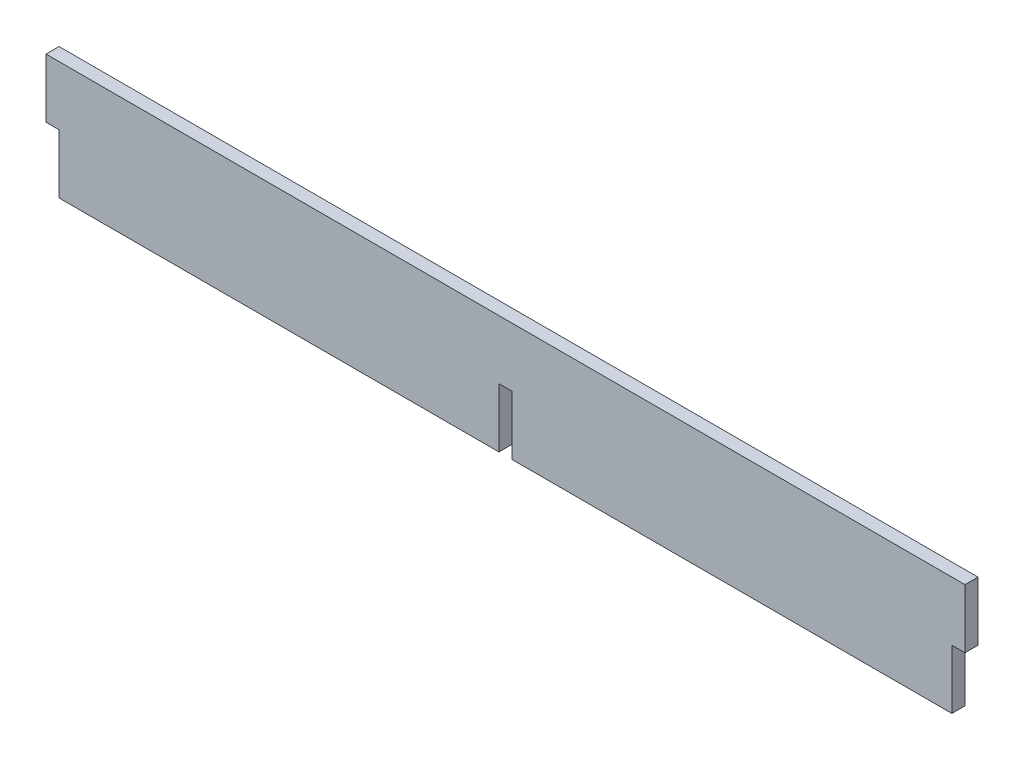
ISO-10303-21;
HEADER;
FILE_DESCRIPTION(('STEP AP214'),'2;1');
FILE_NAME('part.step','',(''),(''),'','','');
FILE_SCHEMA(('AUTOMOTIVE_DESIGN { 1 0 10303 214 1 1 1 1 }'));
ENDSEC;
DATA;
#1=APPLICATION_CONTEXT('core data for automotive mechanical design processes');
#2=APPLICATION_PROTOCOL_DEFINITION('international standard','automotive_design',2000,#1);
#3=PRODUCT_CONTEXT('',#1,'mechanical');
#4=PRODUCT('Part','Part','',(#3));
#5=PRODUCT_RELATED_PRODUCT_CATEGORY('part','',(#4));
#6=PRODUCT_DEFINITION_FORMATION('','',#4);
#7=PRODUCT_DEFINITION_CONTEXT('part definition',#1,'design');
#8=PRODUCT_DEFINITION('design','',#6,#7);
#9=PRODUCT_DEFINITION_SHAPE('','',#8);
#10=(LENGTH_UNIT() NAMED_UNIT(*) SI_UNIT(.MILLI.,.METRE.));
#11=(NAMED_UNIT(*) PLANE_ANGLE_UNIT() SI_UNIT($,.RADIAN.));
#12=(NAMED_UNIT(*) SI_UNIT($,.STERADIAN.) SOLID_ANGLE_UNIT());
#13=UNCERTAINTY_MEASURE_WITH_UNIT(LENGTH_MEASURE(1.E-05),#10,'distance_accuracy_value','');
#14=(GEOMETRIC_REPRESENTATION_CONTEXT(3) GLOBAL_UNCERTAINTY_ASSIGNED_CONTEXT((#13)) GLOBAL_UNIT_ASSIGNED_CONTEXT((#10,
#11,#12)) REPRESENTATION_CONTEXT('',''));
#15=CARTESIAN_POINT('',(0.,0.,0.));
#16=DIRECTION('',(0.,0.,1.));
#17=DIRECTION('',(1.,0.,0.));
#18=AXIS2_PLACEMENT_3D('',#15,#16,#17);
#19=CARTESIAN_POINT('',(0.,14.49,3.2));
#20=DIRECTION('',(-1.,0.,0.));
#21=DIRECTION('',(0.,0.,1.));
#22=AXIS2_PLACEMENT_3D('',#19,#20,#21);
#23=PLANE('',#22);
#24=DIRECTION('',(0.,1.,0.));
#25=VECTOR('',#24,1.);
#26=CARTESIAN_POINT('',(0.,14.49,0.));
#27=LINE('',#26,#25);
#28=CARTESIAN_POINT('',(0.,14.49,0.));
#29=VERTEX_POINT('',#28);
#30=CARTESIAN_POINT('',(0.,28.97,0.));
#31=VERTEX_POINT('',#30);
#32=EDGE_CURVE('E172',#29,#31,#27,.T.);
#33=ORIENTED_EDGE('',*,*,#32,.F.);
#34=DIRECTION('',(0.,0.,-1.));
#35=VECTOR('',#34,1.);
#36=CARTESIAN_POINT('',(0.,14.49,3.2));
#37=LINE('',#36,#35);
#38=CARTESIAN_POINT('',(0.,14.49,3.2));
#39=VERTEX_POINT('',#38);
#40=EDGE_CURVE('E11',#39,#29,#37,.T.);
#41=ORIENTED_EDGE('',*,*,#40,.F.);
#42=DIRECTION('',(0.,1.,0.));
#43=VECTOR('',#42,1.);
#44=CARTESIAN_POINT('',(0.,14.49,3.2));
#45=LINE('',#44,#43);
#46=CARTESIAN_POINT('',(0.,28.97,3.2));
#47=VERTEX_POINT('',#46);
#48=EDGE_CURVE('E213',#39,#47,#45,.T.);
#49=ORIENTED_EDGE('',*,*,#48,.T.);
#50=DIRECTION('',(0.,0.,-1.));
#51=VECTOR('',#50,1.);
#52=CARTESIAN_POINT('',(0.,28.97,3.2));
#53=LINE('',#52,#51);
#54=EDGE_CURVE('E50',#47,#31,#53,.T.);
#55=ORIENTED_EDGE('',*,*,#54,.T.);
#56=EDGE_LOOP('',(#33,#41,#49,#55));
#57=FACE_BOUND('',#56,.T.);
#58=ADVANCED_FACE('F47',(#57),#23,.T.);
#59=CARTESIAN_POINT('',(0.,14.49,3.2));
#60=DIRECTION('',(0.,1.,0.));
#61=DIRECTION('',(0.,0.,1.));
#62=AXIS2_PLACEMENT_3D('',#59,#60,#61);
#63=PLANE('',#62);
#64=DIRECTION('',(1.,0.,0.));
#65=VECTOR('',#64,1.);
#66=CARTESIAN_POINT('',(0.,14.49,0.));
#67=LINE('',#66,#65);
#68=CARTESIAN_POINT('',(3.2,14.49,0.));
#69=VERTEX_POINT('',#68);
#70=EDGE_CURVE('E211',#29,#69,#67,.T.);
#71=ORIENTED_EDGE('',*,*,#70,.T.);
#72=DIRECTION('',(0.,0.,-1.));
#73=VECTOR('',#72,1.);
#74=CARTESIAN_POINT('',(3.2,14.49,3.2));
#75=LINE('',#74,#73);
#76=CARTESIAN_POINT('',(3.2,14.49,3.2));
#77=VERTEX_POINT('',#76);
#78=EDGE_CURVE('E57',#77,#69,#75,.T.);
#79=ORIENTED_EDGE('',*,*,#78,.F.);
#80=DIRECTION('',(1.,0.,0.));
#81=VECTOR('',#80,1.);
#82=CARTESIAN_POINT('',(0.,14.49,3.2));
#83=LINE('',#82,#81);
#84=EDGE_CURVE('E164',#39,#77,#83,.T.);
#85=ORIENTED_EDGE('',*,*,#84,.F.);
#86=ORIENTED_EDGE('',*,*,#40,.T.);
#87=EDGE_LOOP('',(#71,#79,#85,#86));
#88=FACE_BOUND('',#87,.T.);
#89=ADVANCED_FACE('F248',(#88),#63,.F.);
#90=CARTESIAN_POINT('',(3.2,0.,3.2));
#91=DIRECTION('',(-1.,0.,0.));
#92=DIRECTION('',(0.,-1.,0.));
#93=AXIS2_PLACEMENT_3D('',#90,#91,#92);
#94=PLANE('',#93);
#95=DIRECTION('',(0.,1.,0.));
#96=VECTOR('',#95,1.);
#97=CARTESIAN_POINT('',(3.2,0.,0.));
#98=LINE('',#97,#96);
#99=CARTESIAN_POINT('',(3.2,0.,0.));
#100=VERTEX_POINT('',#99);
#101=EDGE_CURVE('E147',#100,#69,#98,.T.);
#102=ORIENTED_EDGE('',*,*,#101,.F.);
#103=DIRECTION('',(0.,0.,-1.));
#104=VECTOR('',#103,1.);
#105=CARTESIAN_POINT('',(3.2,0.,3.2));
#106=LINE('',#105,#104);
#107=CARTESIAN_POINT('',(3.2,0.,3.2));
#108=VERTEX_POINT('',#107);
#109=EDGE_CURVE('E141',#108,#100,#106,.T.);
#110=ORIENTED_EDGE('',*,*,#109,.F.);
#111=DIRECTION('',(0.,1.,0.));
#112=VECTOR('',#111,1.);
#113=CARTESIAN_POINT('',(3.2,0.,3.2));
#114=LINE('',#113,#112);
#115=EDGE_CURVE('E145',#108,#77,#114,.T.);
#116=ORIENTED_EDGE('',*,*,#115,.T.);
#117=ORIENTED_EDGE('',*,*,#78,.T.);
#118=EDGE_LOOP('',(#102,#110,#116,#117));
#119=FACE_BOUND('',#118,.T.);
#120=ADVANCED_FACE('F143',(#119),#94,.T.);
#121=CARTESIAN_POINT('',(3.2,0.,3.2));
#122=DIRECTION('',(0.,1.,0.));
#123=DIRECTION('',(0.,0.,1.));
#124=AXIS2_PLACEMENT_3D('',#121,#122,#123);
#125=PLANE('',#124);
#126=DIRECTION('',(1.,0.,0.));
#127=VECTOR('',#126,1.);
#128=CARTESIAN_POINT('',(3.2,0.,0.));
#129=LINE('',#128,#127);
#130=CARTESIAN_POINT('',(111.115,0.,0.));
#131=VERTEX_POINT('',#130);
#132=EDGE_CURVE('E206',#100,#131,#129,.T.);
#133=ORIENTED_EDGE('',*,*,#132,.T.);
#134=DIRECTION('',(0.,0.,-1.));
#135=VECTOR('',#134,1.);
#136=CARTESIAN_POINT('',(111.115,0.,3.2));
#137=LINE('',#136,#135);
#138=CARTESIAN_POINT('',(111.115,0.,3.2));
#139=VERTEX_POINT('',#138);
#140=EDGE_CURVE('E151',#139,#131,#137,.T.);
#141=ORIENTED_EDGE('',*,*,#140,.F.);
#142=DIRECTION('',(1.,0.,0.));
#143=VECTOR('',#142,1.);
#144=CARTESIAN_POINT('',(3.2,0.,3.2));
#145=LINE('',#144,#143);
#146=EDGE_CURVE('E154',#108,#139,#145,.T.);
#147=ORIENTED_EDGE('',*,*,#146,.F.);
#148=ORIENTED_EDGE('',*,*,#109,.T.);
#149=EDGE_LOOP('',(#133,#141,#147,#148));
#150=FACE_BOUND('',#149,.T.);
#151=ADVANCED_FACE('F155',(#150),#125,.F.);
#152=CARTESIAN_POINT('',(111.115,0.,3.2));
#153=DIRECTION('',(-1.,0.,0.));
#154=DIRECTION('',(0.,0.,1.));
#155=AXIS2_PLACEMENT_3D('',#152,#153,#154);
#156=PLANE('',#155);
#157=DIRECTION('',(0.,1.,0.));
#158=VECTOR('',#157,1.);
#159=CARTESIAN_POINT('',(111.115,0.,0.));
#160=LINE('',#159,#158);
#161=CARTESIAN_POINT('',(111.115,14.49,0.));
#162=VERTEX_POINT('',#161);
#163=EDGE_CURVE('E203',#131,#162,#160,.T.);
#164=ORIENTED_EDGE('',*,*,#163,.T.);
#165=DIRECTION('',(0.,0.,-1.));
#166=VECTOR('',#165,1.);
#167=CARTESIAN_POINT('',(111.115,14.49,3.2));
#168=LINE('',#167,#166);
#169=CARTESIAN_POINT('',(111.115,14.49,3.2));
#170=VERTEX_POINT('',#169);
#171=EDGE_CURVE('E219',#170,#162,#168,.T.);
#172=ORIENTED_EDGE('',*,*,#171,.F.);
#173=DIRECTION('',(0.,1.,0.));
#174=VECTOR('',#173,1.);
#175=CARTESIAN_POINT('',(111.115,0.,3.2));
#176=LINE('',#175,#174);
#177=EDGE_CURVE('E160',#139,#170,#176,.T.);
#178=ORIENTED_EDGE('',*,*,#177,.F.);
#179=ORIENTED_EDGE('',*,*,#140,.T.);
#180=EDGE_LOOP('',(#164,#172,#178,#179));
#181=FACE_BOUND('',#180,.T.);
#182=ADVANCED_FACE('F282',(#181),#156,.F.);
#183=CARTESIAN_POINT('',(111.115,14.49,3.2));
#184=DIRECTION('',(0.,1.,0.));
#185=DIRECTION('',(0.,0.,1.));
#186=AXIS2_PLACEMENT_3D('',#183,#184,#185);
#187=PLANE('',#186);
#188=DIRECTION('',(1.,0.,0.));
#189=VECTOR('',#188,1.);
#190=CARTESIAN_POINT('',(111.115,14.49,0.));
#191=LINE('',#190,#189);
#192=CARTESIAN_POINT('',(114.315,14.49,0.));
#193=VERTEX_POINT('',#192);
#194=EDGE_CURVE('E199',#162,#193,#191,.T.);
#195=ORIENTED_EDGE('',*,*,#194,.T.);
#196=DIRECTION('',(0.,0.,-1.));
#197=VECTOR('',#196,1.);
#198=CARTESIAN_POINT('',(114.315,14.49,3.2));
#199=LINE('',#198,#197);
#200=CARTESIAN_POINT('',(114.315,14.49,3.2));
#201=VERTEX_POINT('',#200);
#202=EDGE_CURVE('E223',#201,#193,#199,.T.);
#203=ORIENTED_EDGE('',*,*,#202,.F.);
#204=DIRECTION('',(1.,0.,0.));
#205=VECTOR('',#204,1.);
#206=CARTESIAN_POINT('',(111.115,14.49,3.2));
#207=LINE('',#206,#205);
#208=EDGE_CURVE('E273',#170,#201,#207,.T.);
#209=ORIENTED_EDGE('',*,*,#208,.F.);
#210=ORIENTED_EDGE('',*,*,#171,.T.);
#211=EDGE_LOOP('',(#195,#203,#209,#210));
#212=FACE_BOUND('',#211,.T.);
#213=ADVANCED_FACE('F286',(#212),#187,.F.);
#214=CARTESIAN_POINT('',(114.315,0.,3.2));
#215=DIRECTION('',(-1.,0.,0.));
#216=DIRECTION('',(0.,0.,1.));
#217=AXIS2_PLACEMENT_3D('',#214,#215,#216);
#218=PLANE('',#217);
#219=DIRECTION('',(0.,1.,0.));
#220=VECTOR('',#219,1.);
#221=CARTESIAN_POINT('',(114.315,0.,0.));
#222=LINE('',#221,#220);
#223=CARTESIAN_POINT('',(114.315,0.,0.));
#224=VERTEX_POINT('',#223);
#225=EDGE_CURVE('E195',#224,#193,#222,.T.);
#226=ORIENTED_EDGE('',*,*,#225,.F.);
#227=DIRECTION('',(0.,0.,-1.));
#228=VECTOR('',#227,1.);
#229=CARTESIAN_POINT('',(114.315,0.,3.2));
#230=LINE('',#229,#228);
#231=CARTESIAN_POINT('',(114.315,0.,3.2));
#232=VERTEX_POINT('',#231);
#233=EDGE_CURVE('E226',#232,#224,#230,.T.);
#234=ORIENTED_EDGE('',*,*,#233,.F.);
#235=DIRECTION('',(0.,1.,0.));
#236=VECTOR('',#235,1.);
#237=CARTESIAN_POINT('',(114.315,0.,3.2));
#238=LINE('',#237,#236);
#239=EDGE_CURVE('E269',#232,#201,#238,.T.);
#240=ORIENTED_EDGE('',*,*,#239,.T.);
#241=ORIENTED_EDGE('',*,*,#202,.T.);
#242=EDGE_LOOP('',(#226,#234,#240,#241));
#243=FACE_BOUND('',#242,.T.);
#244=ADVANCED_FACE('F289',(#243),#218,.T.);
#245=CARTESIAN_POINT('',(114.315,0.,3.2));
#246=DIRECTION('',(0.,1.,0.));
#247=DIRECTION('',(-1.,0.,0.));
#248=AXIS2_PLACEMENT_3D('',#245,#246,#247);
#249=PLANE('',#248);
#250=DIRECTION('',(1.,0.,0.));
#251=VECTOR('',#250,1.);
#252=CARTESIAN_POINT('',(114.315,0.,0.));
#253=LINE('',#252,#251);
#254=CARTESIAN_POINT('',(222.225,0.,0.));
#255=VERTEX_POINT('',#254);
#256=EDGE_CURVE('E192',#224,#255,#253,.T.);
#257=ORIENTED_EDGE('',*,*,#256,.T.);
#258=DIRECTION('',(0.,0.,-1.));
#259=VECTOR('',#258,1.);
#260=CARTESIAN_POINT('',(222.225,0.,3.2));
#261=LINE('',#260,#259);
#262=CARTESIAN_POINT('',(222.225,0.,3.2));
#263=VERTEX_POINT('',#262);
#264=EDGE_CURVE('E229',#263,#255,#261,.T.);
#265=ORIENTED_EDGE('',*,*,#264,.F.);
#266=DIRECTION('',(1.,0.,0.));
#267=VECTOR('',#266,1.);
#268=CARTESIAN_POINT('',(114.315,0.,3.2));
#269=LINE('',#268,#267);
#270=EDGE_CURVE('E266',#232,#263,#269,.T.);
#271=ORIENTED_EDGE('',*,*,#270,.F.);
#272=ORIENTED_EDGE('',*,*,#233,.T.);
#273=EDGE_LOOP('',(#257,#265,#271,#272));
#274=FACE_BOUND('',#273,.T.);
#275=ADVANCED_FACE('F296',(#274),#249,.F.);
#276=CARTESIAN_POINT('',(222.225,0.,3.2));
#277=DIRECTION('',(-1.,0.,0.));
#278=DIRECTION('',(0.,0.,1.));
#279=AXIS2_PLACEMENT_3D('',#276,#277,#278);
#280=PLANE('',#279);
#281=DIRECTION('',(0.,1.,0.));
#282=VECTOR('',#281,1.);
#283=CARTESIAN_POINT('',(222.225,0.,0.));
#284=LINE('',#283,#282);
#285=CARTESIAN_POINT('',(222.225,14.49,0.));
#286=VERTEX_POINT('',#285);
#287=EDGE_CURVE('E188',#255,#286,#284,.T.);
#288=ORIENTED_EDGE('',*,*,#287,.T.);
#289=DIRECTION('',(0.,0.,-1.));
#290=VECTOR('',#289,1.);
#291=CARTESIAN_POINT('',(222.225,14.49,3.2));
#292=LINE('',#291,#290);
#293=CARTESIAN_POINT('',(222.225,14.49,3.2));
#294=VERTEX_POINT('',#293);
#295=EDGE_CURVE('E233',#294,#286,#292,.T.);
#296=ORIENTED_EDGE('',*,*,#295,.F.);
#297=DIRECTION('',(0.,1.,0.));
#298=VECTOR('',#297,1.);
#299=CARTESIAN_POINT('',(222.225,0.,3.2));
#300=LINE('',#299,#298);
#301=EDGE_CURVE('E263',#263,#294,#300,.T.);
#302=ORIENTED_EDGE('',*,*,#301,.F.);
#303=ORIENTED_EDGE('',*,*,#264,.T.);
#304=EDGE_LOOP('',(#288,#296,#302,#303));
#305=FACE_BOUND('',#304,.T.);
#306=ADVANCED_FACE('F300',(#305),#280,.F.);
#307=CARTESIAN_POINT('',(225.425,14.49,3.2));
#308=DIRECTION('',(0.,-1.,0.));
#309=DIRECTION('',(0.,0.,-1.));
#310=AXIS2_PLACEMENT_3D('',#307,#308,#309);
#311=PLANE('',#310);
#312=DIRECTION('',(-1.,0.,0.));
#313=VECTOR('',#312,1.);
#314=CARTESIAN_POINT('',(225.425,14.49,0.));
#315=LINE('',#314,#313);
#316=CARTESIAN_POINT('',(225.425,14.49,0.));
#317=VERTEX_POINT('',#316);
#318=EDGE_CURVE('E184',#317,#286,#315,.T.);
#319=ORIENTED_EDGE('',*,*,#318,.F.);
#320=DIRECTION('',(0.,0.,-1.));
#321=VECTOR('',#320,1.);
#322=CARTESIAN_POINT('',(225.425,14.49,3.2));
#323=LINE('',#322,#321);
#324=CARTESIAN_POINT('',(225.425,14.49,3.2));
#325=VERTEX_POINT('',#324);
#326=EDGE_CURVE('E236',#325,#317,#323,.T.);
#327=ORIENTED_EDGE('',*,*,#326,.F.);
#328=DIRECTION('',(-1.,0.,0.));
#329=VECTOR('',#328,1.);
#330=CARTESIAN_POINT('',(225.425,14.49,3.2));
#331=LINE('',#330,#329);
#332=EDGE_CURVE('E259',#325,#294,#331,.T.);
#333=ORIENTED_EDGE('',*,*,#332,.T.);
#334=ORIENTED_EDGE('',*,*,#295,.T.);
#335=EDGE_LOOP('',(#319,#327,#333,#334));
#336=FACE_BOUND('',#335,.T.);
#337=ADVANCED_FACE('F303',(#336),#311,.T.);
#338=CARTESIAN_POINT('',(225.425,14.49,3.2));
#339=DIRECTION('',(-1.,0.,0.));
#340=DIRECTION('',(0.,0.,1.));
#341=AXIS2_PLACEMENT_3D('',#338,#339,#340);
#342=PLANE('',#341);
#343=DIRECTION('',(0.,1.,0.));
#344=VECTOR('',#343,1.);
#345=CARTESIAN_POINT('',(225.425,14.49,0.));
#346=LINE('',#345,#344);
#347=CARTESIAN_POINT('',(225.425,28.97,0.));
#348=VERTEX_POINT('',#347);
#349=EDGE_CURVE('E180',#317,#348,#346,.T.);
#350=ORIENTED_EDGE('',*,*,#349,.T.);
#351=DIRECTION('',(0.,0.,-1.));
#352=VECTOR('',#351,1.);
#353=CARTESIAN_POINT('',(225.425,28.97,3.2));
#354=LINE('',#353,#352);
#355=CARTESIAN_POINT('',(225.425,28.97,3.2));
#356=VERTEX_POINT('',#355);
#357=EDGE_CURVE('E238',#356,#348,#354,.T.);
#358=ORIENTED_EDGE('',*,*,#357,.F.);
#359=DIRECTION('',(0.,1.,0.));
#360=VECTOR('',#359,1.);
#361=CARTESIAN_POINT('',(225.425,14.49,3.2));
#362=LINE('',#361,#360);
#363=EDGE_CURVE('E254',#325,#356,#362,.T.);
#364=ORIENTED_EDGE('',*,*,#363,.F.);
#365=ORIENTED_EDGE('',*,*,#326,.T.);
#366=EDGE_LOOP('',(#350,#358,#364,#365));
#367=FACE_BOUND('',#366,.T.);
#368=ADVANCED_FACE('F306',(#367),#342,.F.);
#369=CARTESIAN_POINT('',(0.,28.97,3.2));
#370=DIRECTION('',(0.,1.,0.));
#371=DIRECTION('',(0.,0.,1.));
#372=AXIS2_PLACEMENT_3D('',#369,#370,#371);
#373=PLANE('',#372);
#374=DIRECTION('',(1.,0.,0.));
#375=VECTOR('',#374,1.);
#376=CARTESIAN_POINT('',(0.,28.97,0.));
#377=LINE('',#376,#375);
#378=EDGE_CURVE('E176',#31,#348,#377,.T.);
#379=ORIENTED_EDGE('',*,*,#378,.F.);
#380=ORIENTED_EDGE('',*,*,#54,.F.);
#381=DIRECTION('',(1.,0.,0.));
#382=VECTOR('',#381,1.);
#383=CARTESIAN_POINT('',(0.,28.97,3.2));
#384=LINE('',#383,#382);
#385=EDGE_CURVE('E249',#47,#356,#384,.T.);
#386=ORIENTED_EDGE('',*,*,#385,.T.);
#387=ORIENTED_EDGE('',*,*,#357,.T.);
#388=EDGE_LOOP('',(#379,#380,#386,#387));
#389=FACE_BOUND('',#388,.T.);
#390=ADVANCED_FACE('F244',(#389),#373,.T.);
#391=CARTESIAN_POINT('',(0.,0.,3.2));
#392=DIRECTION('',(0.,0.,-1.));
#393=DIRECTION('',(-1.,0.,0.));
#394=AXIS2_PLACEMENT_3D('',#391,#392,#393);
#395=PLANE('',#394);
#396=ORIENTED_EDGE('',*,*,#48,.F.);
#397=ORIENTED_EDGE('',*,*,#84,.T.);
#398=ORIENTED_EDGE('',*,*,#115,.F.);
#399=ORIENTED_EDGE('',*,*,#146,.T.);
#400=ORIENTED_EDGE('',*,*,#177,.T.);
#401=ORIENTED_EDGE('',*,*,#208,.T.);
#402=ORIENTED_EDGE('',*,*,#239,.F.);
#403=ORIENTED_EDGE('',*,*,#270,.T.);
#404=ORIENTED_EDGE('',*,*,#301,.T.);
#405=ORIENTED_EDGE('',*,*,#332,.F.);
#406=ORIENTED_EDGE('',*,*,#363,.T.);
#407=ORIENTED_EDGE('',*,*,#385,.F.);
#408=EDGE_LOOP('',(#396,#397,#398,#399,#400,#401,#402,#403,#404,#405,#406,#407));
#409=FACE_BOUND('',#408,.T.);
#410=ADVANCED_FACE('F163',(#409),#395,.F.);
#411=CARTESIAN_POINT('',(0.,0.,0.));
#412=DIRECTION('',(0.,0.,-1.));
#413=DIRECTION('',(-1.,0.,0.));
#414=AXIS2_PLACEMENT_3D('',#411,#412,#413);
#415=PLANE('',#414);
#416=ORIENTED_EDGE('',*,*,#32,.T.);
#417=ORIENTED_EDGE('',*,*,#378,.T.);
#418=ORIENTED_EDGE('',*,*,#349,.F.);
#419=ORIENTED_EDGE('',*,*,#318,.T.);
#420=ORIENTED_EDGE('',*,*,#287,.F.);
#421=ORIENTED_EDGE('',*,*,#256,.F.);
#422=ORIENTED_EDGE('',*,*,#225,.T.);
#423=ORIENTED_EDGE('',*,*,#194,.F.);
#424=ORIENTED_EDGE('',*,*,#163,.F.);
#425=ORIENTED_EDGE('',*,*,#132,.F.);
#426=ORIENTED_EDGE('',*,*,#101,.T.);
#427=ORIENTED_EDGE('',*,*,#70,.F.);
#428=EDGE_LOOP('',(#416,#417,#418,#419,#420,#421,#422,#423,#424,#425,#426,#427));
#429=FACE_BOUND('',#428,.T.);
#430=ADVANCED_FACE('F247',(#429),#415,.T.);
#431=CLOSED_SHELL('',(#58,#89,#120,#151,#182,#213,#244,#275,#306,#337,#368,#390,#410,#430));
#432=MANIFOLD_SOLID_BREP('B2',#431);
#433=ADVANCED_BREP_SHAPE_REPRESENTATION('',(#18,#432),#14);
#434=SHAPE_DEFINITION_REPRESENTATION(#9,#433);
ENDSEC;
END-ISO-10303-21;
